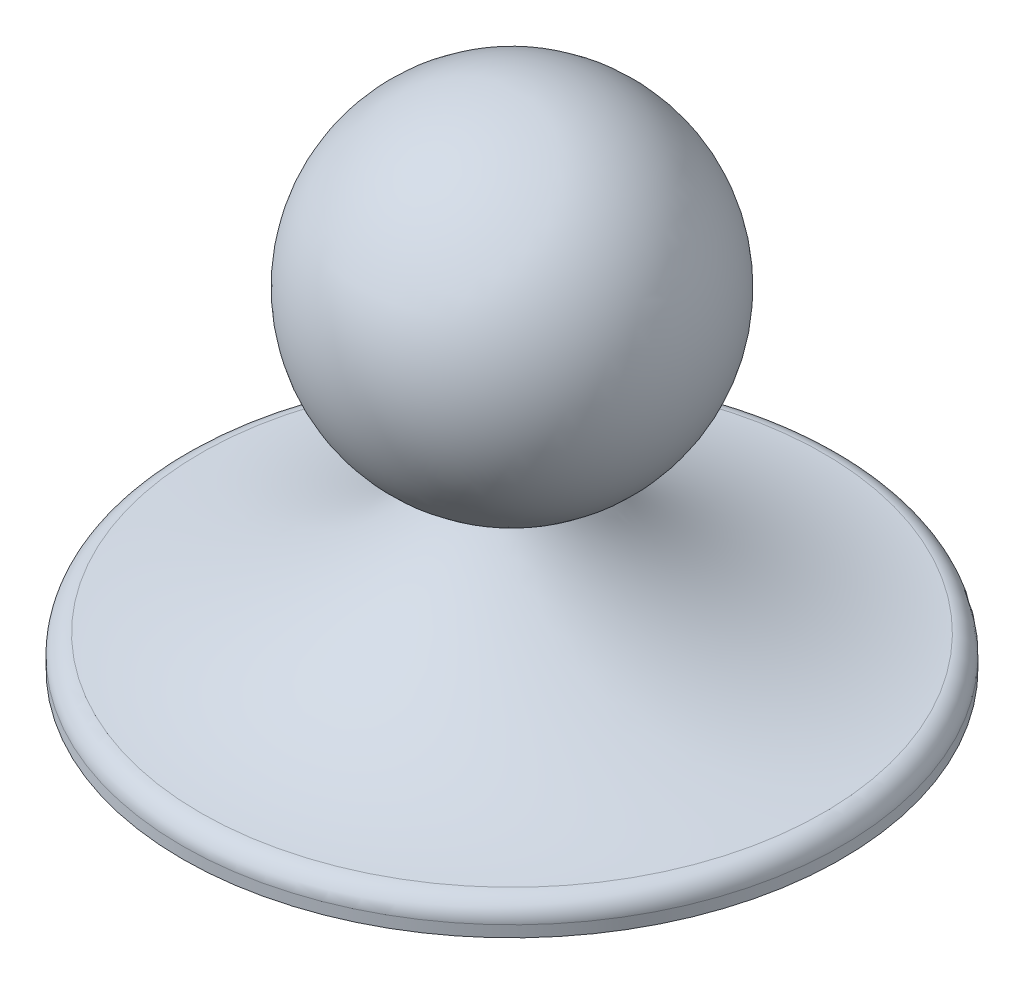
ISO-10303-21;
HEADER;
FILE_DESCRIPTION(('STEP AP214'),'2;1');
FILE_NAME('part.step','',(''),(''),'','','');
FILE_SCHEMA(('AUTOMOTIVE_DESIGN { 1 0 10303 214 1 1 1 1 }'));
ENDSEC;
DATA;
#1=APPLICATION_CONTEXT('core data for automotive mechanical design processes');
#2=APPLICATION_PROTOCOL_DEFINITION('international standard','automotive_design',2000,#1);
#3=PRODUCT_CONTEXT('',#1,'mechanical');
#4=PRODUCT('Part','Part','',(#3));
#5=PRODUCT_RELATED_PRODUCT_CATEGORY('part','',(#4));
#6=PRODUCT_DEFINITION_FORMATION('','',#4);
#7=PRODUCT_DEFINITION_CONTEXT('part definition',#1,'design');
#8=PRODUCT_DEFINITION('design','',#6,#7);
#9=PRODUCT_DEFINITION_SHAPE('','',#8);
#10=(LENGTH_UNIT() NAMED_UNIT(*) SI_UNIT(.MILLI.,.METRE.));
#11=(NAMED_UNIT(*) PLANE_ANGLE_UNIT() SI_UNIT($,.RADIAN.));
#12=(NAMED_UNIT(*) SI_UNIT($,.STERADIAN.) SOLID_ANGLE_UNIT());
#13=UNCERTAINTY_MEASURE_WITH_UNIT(LENGTH_MEASURE(1.E-05),#10,'distance_accuracy_value','');
#14=(GEOMETRIC_REPRESENTATION_CONTEXT(3) GLOBAL_UNCERTAINTY_ASSIGNED_CONTEXT((#13)) GLOBAL_UNIT_ASSIGNED_CONTEXT((#10,
#11,#12)) REPRESENTATION_CONTEXT('',''));
#15=CARTESIAN_POINT('',(0.,0.,0.));
#16=DIRECTION('',(0.,0.,1.));
#17=DIRECTION('',(1.,0.,0.));
#18=AXIS2_PLACEMENT_3D('',#15,#16,#17);
#19=CARTESIAN_POINT('',(0.,27.0730234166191,0.));
#20=DIRECTION('',(0.,1.,0.));
#21=DIRECTION('',(1.,0.,0.));
#22=AXIS2_PLACEMENT_3D('',#19,#20,#21);
#23=SPHERICAL_SURFACE('',#22,12.9269765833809);
#24=CARTESIAN_POINT('',(0.,14.7943664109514,0.));
#25=DIRECTION('',(0.,1.,0.));
#26=DIRECTION('',(0.,0.,1.));
#27=AXIS2_PLACEMENT_3D('',#24,#25,#26);
#28=CIRCLE('',#27,4.04243809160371);
#29=CARTESIAN_POINT('',(0.,14.7943664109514,4.04243809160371));
#30=VERTEX_POINT('',#29);
#31=EDGE_CURVE('E53',#30,#30,#28,.T.);
#32=ORIENTED_EDGE('',*,*,#31,.T.);
#33=EDGE_LOOP('',(#32));
#34=FACE_BOUND('',#33,.T.);
#35=ADVANCED_FACE('F30',(#34),#23,.T.);
#36=CARTESIAN_POINT('',(0.,0.,0.));
#37=DIRECTION('',(0.,1.,0.));
#38=DIRECTION('',(0.,0.,1.));
#39=AXIS2_PLACEMENT_3D('',#36,#37,#38);
#40=PLANE('',#39);
#41=CARTESIAN_POINT('',(0.,0.,0.));
#42=DIRECTION('',(0.,1.,0.));
#43=DIRECTION('',(0.,0.,1.));
#44=AXIS2_PLACEMENT_3D('',#41,#42,#43);
#45=CIRCLE('',#44,20.);
#46=CARTESIAN_POINT('',(0.,0.,20.));
#47=VERTEX_POINT('',#46);
#48=EDGE_CURVE('E41',#47,#47,#45,.T.);
#49=ORIENTED_EDGE('',*,*,#48,.F.);
#50=EDGE_LOOP('',(#49));
#51=FACE_BOUND('',#50,.T.);
#52=ADVANCED_FACE('F76',(#51),#40,.F.);
#53=CARTESIAN_POINT('',(0.,42.0264564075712,0.));
#54=DIRECTION('',(0.,1.,0.));
#55=DIRECTION('',(0.,0.,1.));
#56=AXIS2_PLACEMENT_3D('',#53,#54,#55);
#57=CYLINDRICAL_SURFACE('',#56,20.);
#58=CARTESIAN_POINT('',(0.,2.,0.));
#59=DIRECTION('',(0.,1.,0.));
#60=DIRECTION('',(0.,0.,1.));
#61=AXIS2_PLACEMENT_3D('',#58,#59,#60);
#62=CIRCLE('',#61,20.);
#63=CARTESIAN_POINT('',(0.,2.,20.));
#64=VERTEX_POINT('',#63);
#65=EDGE_CURVE('E45',#64,#64,#62,.T.);
#66=ORIENTED_EDGE('',*,*,#65,.F.);
#67=EDGE_LOOP('',(#66));
#68=FACE_BOUND('',#67,.T.);
#69=ORIENTED_EDGE('',*,*,#48,.T.);
#70=EDGE_LOOP('',(#69));
#71=FACE_BOUND('',#70,.T.);
#72=ADVANCED_FACE('F72',(#68,#71),#57,.T.);
#73=CARTESIAN_POINT('',(0.,2.,0.));
#74=DIRECTION('',(0.,1.,0.));
#75=DIRECTION('',(0.,0.,1.));
#76=AXIS2_PLACEMENT_3D('',#73,#74,#75);
#77=PLANE('',#76);
#78=CARTESIAN_POINT('',(0.,2.,0.));
#79=DIRECTION('',(0.,1.,0.));
#80=DIRECTION('',(0.,0.,1.));
#81=AXIS2_PLACEMENT_3D('',#78,#79,#80);
#82=CIRCLE('',#81,25.);
#83=CARTESIAN_POINT('',(0.,2.,25.));
#84=VERTEX_POINT('',#83);
#85=EDGE_CURVE('E50',#84,#84,#82,.T.);
#86=ORIENTED_EDGE('',*,*,#85,.F.);
#87=EDGE_LOOP('',(#86));
#88=FACE_BOUND('',#87,.T.);
#89=ORIENTED_EDGE('',*,*,#65,.T.);
#90=EDGE_LOOP('',(#89));
#91=FACE_BOUND('',#90,.T.);
#92=ADVANCED_FACE('F69',(#88,#91),#77,.F.);
#93=CARTESIAN_POINT('',(0.,42.0264564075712,0.));
#94=DIRECTION('',(0.,1.,0.));
#95=DIRECTION('',(0.,0.,1.));
#96=AXIS2_PLACEMENT_3D('',#93,#94,#95);
#97=CYLINDRICAL_SURFACE('',#96,25.);
#98=CARTESIAN_POINT('',(0.,2.8566165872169,0.));
#99=DIRECTION('',(0.,-1.,0.));
#100=DIRECTION('',(0.,0.,-1.));
#101=AXIS2_PLACEMENT_3D('',#98,#99,#100);
#102=CIRCLE('',#101,25.);
#103=CARTESIAN_POINT('',(0.,2.8566165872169,-25.));
#104=VERTEX_POINT('',#103);
#105=EDGE_CURVE('E10',#104,#104,#102,.T.);
#106=ORIENTED_EDGE('',*,*,#105,.T.);
#107=EDGE_LOOP('',(#106));
#108=FACE_BOUND('',#107,.T.);
#109=ORIENTED_EDGE('',*,*,#85,.T.);
#110=EDGE_LOOP('',(#109));
#111=FACE_BOUND('',#110,.T.);
#112=ADVANCED_FACE('F66',(#108,#111),#97,.T.);
#113=CARTESIAN_POINT('',(25.,4.27410984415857,0.));
#114=CARTESIAN_POINT('',(16.0013711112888,4.51501170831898,0.));
#115=CARTESIAN_POINT('',(6.99810663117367,10.0523680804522,0.));
#116=CARTESIAN_POINT('',(4.0424380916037,14.7943664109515,0.));
#117=B_SPLINE_CURVE_WITH_KNOTS('',3,(#113,#114,#115,#116),.UNSPECIFIED.,.F.,.F.,(4,4),(0.,1.),.UNSPECIFIED.);
#118=CARTESIAN_POINT('',(0.,42.0264564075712,0.));
#119=DIRECTION('',(0.,1.,0.));
#120=AXIS1_PLACEMENT('',#118,#119);
#121=SURFACE_OF_REVOLUTION('',#117,#120);
#122=CARTESIAN_POINT('',(0.,4.35121948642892,0.));
#123=DIRECTION('',(0.,1.,0.));
#124=DIRECTION('',(0.,0.,1.));
#125=AXIS2_PLACEMENT_3D('',#122,#123,#124);
#126=CIRCLE('',#125,23.6271305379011);
#127=CARTESIAN_POINT('',(0.,4.35121948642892,23.6271305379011));
#128=VERTEX_POINT('',#127);
#129=EDGE_CURVE('E37',#128,#128,#126,.T.);
#130=ORIENTED_EDGE('',*,*,#129,.T.);
#131=EDGE_LOOP('',(#130));
#132=FACE_BOUND('',#131,.T.);
#133=ORIENTED_EDGE('',*,*,#31,.F.);
#134=EDGE_LOOP('',(#133));
#135=FACE_BOUND('',#134,.T.);
#136=ADVANCED_FACE('F63',(#132,#135),#121,.T.);
#137=CARTESIAN_POINT('',(0.,2.8566165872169,0.));
#138=DIRECTION('',(0.,-1.,0.));
#139=DIRECTION('',(0.,0.,-1.));
#140=AXIS2_PLACEMENT_3D('',#137,#138,#139);
#141=TOROIDAL_SURFACE('',#140,23.5,1.5);
#142=ORIENTED_EDGE('',*,*,#105,.F.);
#143=EDGE_LOOP('',(#142));
#144=FACE_BOUND('',#143,.T.);
#145=ORIENTED_EDGE('',*,*,#129,.F.);
#146=EDGE_LOOP('',(#145));
#147=FACE_BOUND('',#146,.T.);
#148=ADVANCED_FACE('F32',(#144,#147),#141,.T.);
#149=CLOSED_SHELL('',(#35,#52,#72,#92,#112,#136,#148));
#150=MANIFOLD_SOLID_BREP('B2',#149);
#151=ADVANCED_BREP_SHAPE_REPRESENTATION('',(#18,#150),#14);
#152=SHAPE_DEFINITION_REPRESENTATION(#9,#151);
ENDSEC;
END-ISO-10303-21;
